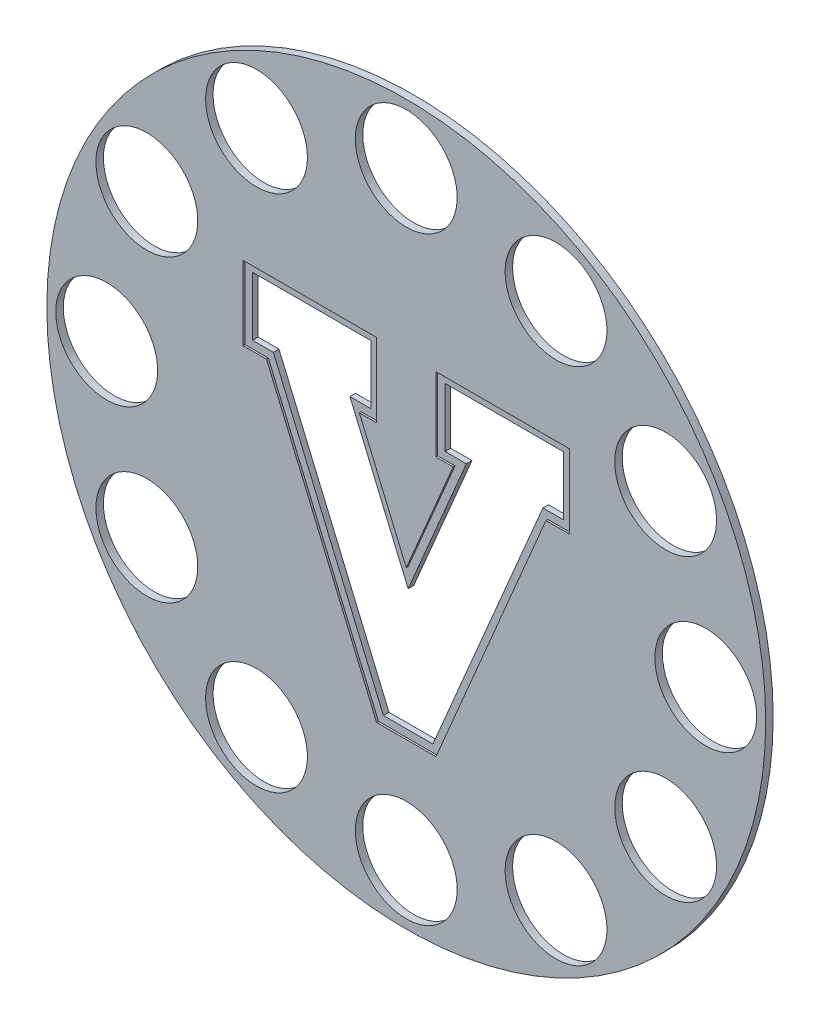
from build123d import *

# Parameters (mm, degrees)
SKETCH1_R               = 609.6
SKETCH1_R_2             = 86.36
BOSS_EXTRUDE1_DEPTH     = 12.7
CUT_EXTRUDE1_DEPTH      = 863.198126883
CUT_EXTRUDE1_DEPTH_BACK = 3.175


with BuildPart() as part:
    # Sketch1 → Boss-Extrude1 (new body)
    with BuildSketch(Plane.XY):
        with Locations(Location((0, 0, 0), (0, 0, 180))):
            Circle(SKETCH1_R)
        with Locations(Location((0, 508, 0), (0, 0, 180))):
            Circle(SKETCH1_R_2, mode=Mode.SUBTRACT)
        with Locations(Location((254, 439.940905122, 0), (0, 0, 180))):
            Circle(SKETCH1_R_2, mode=Mode.SUBTRACT)
        with Locations(Location((439.940905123, 254, 0), (0, 0, 180))):
            Circle(SKETCH1_R_2, mode=Mode.SUBTRACT)
        with Locations(Location((508, 0, 0), (0, 0, 180))):
            Circle(SKETCH1_R_2, mode=Mode.SUBTRACT)
        with Locations(Location((439.940905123, -254, 0), (0, 0, 180))):
            Circle(SKETCH1_R_2, mode=Mode.SUBTRACT)
        with Locations(Location((254, -439.940905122, 0), (0, 0, 180))):
            Circle(SKETCH1_R_2, mode=Mode.SUBTRACT)
        with Locations(Location((0, -508, 0), (0, 0, 180))):
            Circle(SKETCH1_R_2, mode=Mode.SUBTRACT)
        with Locations(Location((-254, -439.940905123, 0), (0, 0, 180))):
            Circle(SKETCH1_R_2, mode=Mode.SUBTRACT)
        with Locations(Location((-439.940905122, -254, 0), (0, 0, 180))):
            Circle(SKETCH1_R_2, mode=Mode.SUBTRACT)
        with Locations(Location((-508, 0, 0), (0, 0, 180))):
            Circle(SKETCH1_R_2, mode=Mode.SUBTRACT)
        with Locations(Location((-439.940905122, 254, 0), (0, 0, 180))):
            Circle(SKETCH1_R_2, mode=Mode.SUBTRACT)
        with Locations(Location((-254, 439.940905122, 0), (0, 0, 180))):
            Circle(SKETCH1_R_2, mode=Mode.SUBTRACT)
        Polygon((-263.817141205, 221.767857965), (-62.758262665, 221.767857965), (-62.758262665, 121.81951372), (-98.786154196, 121.81951372), (0, -111.199591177), (98.786154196, 121.81951372), (62.758262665, 121.81951372), (62.758262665, 221.767857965), (263.817141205, 221.767857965), (263.817141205, 121.81951372), (228.547895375, 121.81951372), (41.969279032, -318.286516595), (-41.969279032, -318.286516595), (-228.547895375, 121.81951372), (-263.817141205, 121.81951372), align=None, mode=Mode.SUBTRACT)
    extrude(amount=BOSS_EXTRUDE1_DEPTH)

    # Sketch2 → Cut-Extrude1 (cut, two sides: drawn at the far end of the back side and taken through both)
    with BuildSketch(Plane.XY.offset(12.7).offset(-CUT_EXTRUDE1_DEPTH_BACK)):
        Polygon((50.058262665, 109.11951372), (79.607989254, 109.11951372), (0, -78.661684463), (-79.607989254, 109.11951372), (-50.058262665, 109.11951372), (-50.058262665, 234.467857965), (-276.517141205, 234.467857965), (-276.517141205, 109.11951372), (-236.957980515, 109.11951372), (-50.379364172, -330.986516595), (50.379364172, -330.986516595), (236.957980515, 109.11951372), (276.517141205, 109.11951372), (276.517141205, 234.467857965), (50.058262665, 234.467857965), align=None)
        Polygon((-41.969279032, -318.286516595), (-228.547895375, 121.81951372), (-263.817141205, 121.81951372), (-263.817141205, 221.767857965), (-62.758262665, 221.767857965), (-62.758262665, 121.81951372), (-98.786154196, 121.81951372), (0, -111.199591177), (98.786154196, 121.81951372), (62.758262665, 121.81951372), (62.758262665, 221.767857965), (263.817141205, 221.767857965), (263.817141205, 121.81951372), (228.547895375, 121.81951372), (41.969279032, -318.286516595), align=None, mode=Mode.SUBTRACT)
    extrude(amount=CUT_EXTRUDE1_DEPTH + CUT_EXTRUDE1_DEPTH_BACK, mode=Mode.SUBTRACT)


solid = part.part
